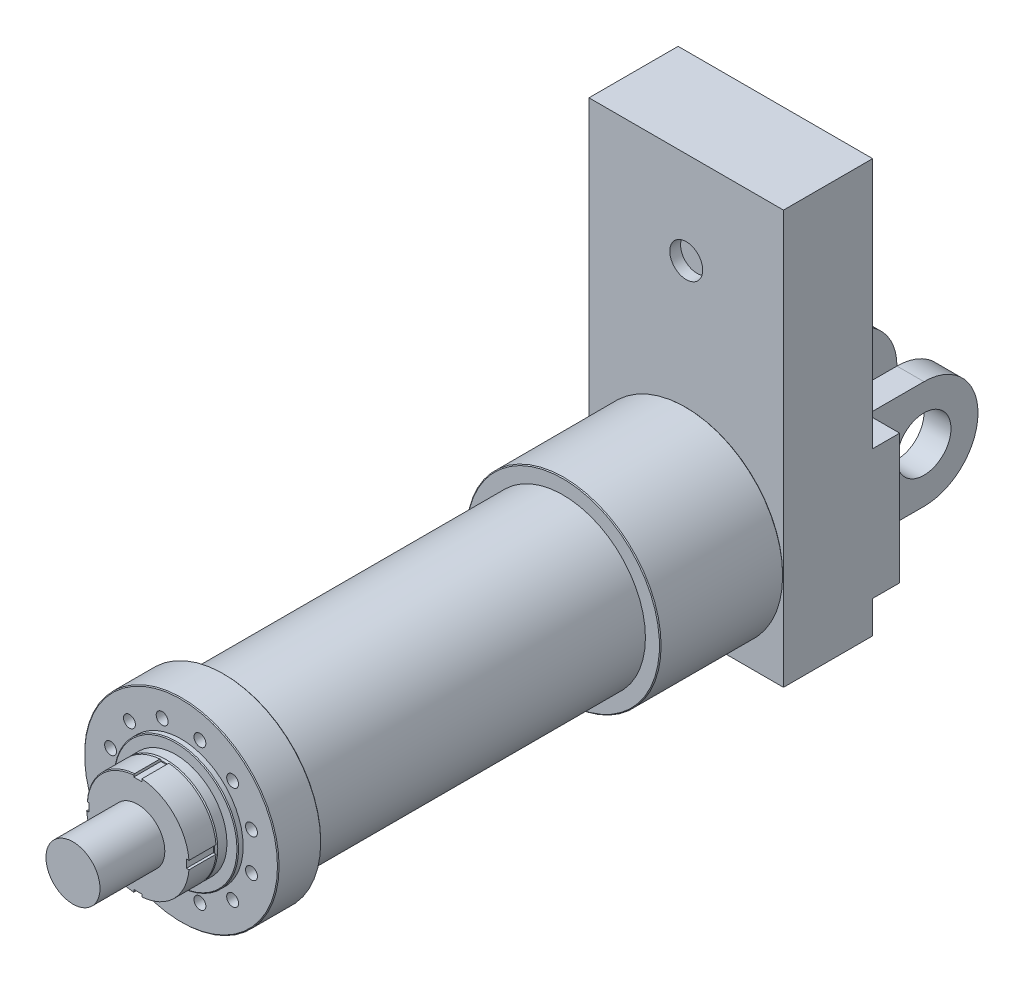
from build123d import *

# Parameters (mm, degrees)
SKETCH_1_R          = 152.5
EXTRUDE_1_DEPTH     = 627
SKETCH_2_R          = 180
SKETCH_2_R_2        = 11
EXTRUDE_2_DEPTH     = 80
SKETCH_3_R          = 115
EXTRUDE_3_DEPTH     = 10
SKETCH_4_R          = 95
EXTRUDE_4_DEPTH     = 20
CHAMFER_1_SIZE      = 3
EXTRUDE_5_DEPTH     = 50
CHAMFER_2_SIZE      = 1.5
EXTRUDE_START       = 228
SKETCH_11_R         = 180
EXTRUDE_10_DEPTH    = 228
CHAMFER_5_SIZE      = 1.5
EXTRUDE_11_DEPTH    = 165
SKETCH_16_R         = 16
CUT_EXTRUDE_4_DEPTH = 2
SKETCH_18_R         = 30.440746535
CUT_EXTRUDE_6_DEPTH = 20
SKETCH_19_R         = 50
EXTRUDE_12_DEPTH    = 120
SKETCH_20_W         = 360
SKETCH_20_H         = 240
EXTRUDE_13_DEPTH    = 50
SKETCH_21_W         = 50
SKETCH_21_H         = 200
EXTRUDE_14_DEPTH    = 225
SKETCH_22_R         = 50
CUT_EXTRUDE_7_DEPTH = 225
CHAMFER_6_SIZE      = 15


with BuildPart() as part:
    # Sketch 1 → Extrude 1 (new body)
    with BuildSketch(Plane.XY):
        Circle(SKETCH_1_R)
    extrude(amount=EXTRUDE_1_DEPTH)

    # Sketch 2 → Extrude 2 (add)
    with BuildSketch(Plane.XY.offset(627)):
        Circle(SKETCH_2_R)
        with Locations((130.399986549, 34.940571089)):
            Circle(SKETCH_2_R_2, mode=Mode.SUBTRACT)
        with Locations((130.399986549, -34.940571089)):
            Circle(SKETCH_2_R_2, mode=Mode.SUBTRACT)
        with Locations((95.45941546, -95.45941546)):
            Circle(SKETCH_2_R_2, mode=Mode.SUBTRACT)
        with Locations((34.940571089, -130.399986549)):
            Circle(SKETCH_2_R_2, mode=Mode.SUBTRACT)
        with Locations((-34.940571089, -130.399986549)):
            Circle(SKETCH_2_R_2, mode=Mode.SUBTRACT)
        with Locations((-95.45941546, -95.45941546)):
            Circle(SKETCH_2_R_2, mode=Mode.SUBTRACT)
        with Locations((-130.399986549, -34.940571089)):
            Circle(SKETCH_2_R_2, mode=Mode.SUBTRACT)
        with Locations((-130.399986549, 34.940571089)):
            Circle(SKETCH_2_R_2, mode=Mode.SUBTRACT)
        with Locations((-95.45941546, 95.45941546)):
            Circle(SKETCH_2_R_2, mode=Mode.SUBTRACT)
        with Locations((-34.940571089, 130.399986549)):
            Circle(SKETCH_2_R_2, mode=Mode.SUBTRACT)
        with Locations((34.940571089, 130.399986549)):
            Circle(SKETCH_2_R_2, mode=Mode.SUBTRACT)
        with Locations((95.45941546, 95.45941546)):
            Circle(SKETCH_2_R_2, mode=Mode.SUBTRACT)
    extrude(amount=EXTRUDE_2_DEPTH)

    # Sketch 3 → Extrude 3 (add)
    with BuildSketch(Plane.XY.offset(707)):
        Circle(SKETCH_3_R)
    extrude(amount=EXTRUDE_3_DEPTH)

    # Sketch 4 → Extrude 4 (add)
    with BuildSketch(Plane.XY.offset(717)):
        Circle(SKETCH_4_R)
    extrude(amount=EXTRUDE_4_DEPTH)

    # Chamfer 1
    chamfer_1_edges = [part.edges().sort_by_distance(p)[0] for p in [
        (-95, 0, 737),
    ]]
    chamfer(chamfer_1_edges, length=CHAMFER_1_SIZE)

    # Sketch 5 → Extrude 5 (add)
    with BuildSketch(Plane.XY.offset(737)):
        with BuildLine():
            Line((-7.5, 94.703484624), (-7.5, 90))
            Line((-7.5, 90), (7.5, 90))
            Line((7.5, 90), (7.5, 94.703484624))
            ThreePointArc((7.5, 94.703484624), (67.175144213, 67.175144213), (94.703484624, 7.5))
            Line((94.703484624, 7.5), (90, 7.5))
            Line((90, 7.5), (90, -7.5))
            Line((90, -7.5), (94.703484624, -7.5))
            ThreePointArc((94.703484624, -7.5), (67.175144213, -67.175144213), (7.5, -94.703484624))
            Line((7.5, -94.703484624), (7.5, -90))
            Line((7.5, -90), (-7.5, -90))
            Line((-7.5, -90), (-7.5, -94.703484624))
            ThreePointArc((-7.5, -94.703484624), (-67.175144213, -67.175144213), (-94.703484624, -7.5))
            Line((-94.703484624, -7.5), (-90, -7.5))
            Line((-90, -7.5), (-90, 7.5))
            Line((-90, 7.5), (-94.703484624, 7.5))
            ThreePointArc((-94.703484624, 7.5), (-67.175144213, 67.175144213), (-7.5, 94.703484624))
        make_face()
    extrude(amount=EXTRUDE_5_DEPTH)

    # Chamfer 2
    chamfer_2_edges = [part.edges().sort_by_distance(p)[0] for p in [
        (-180, 0, 707),
        (-180, 0, 627),
        (-115, 0, 717),
        (-67.175144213, 67.175144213, 737),
        (-67.175144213, 67.175144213, 787),
    ]]
    chamfer(chamfer_2_edges, length=CHAMFER_2_SIZE)

    # Sketch 11 → Extrude 10 (add)
    with BuildSketch(Plane(origin=(0, 0, 0), x_dir=(-1, 0, 0), z_dir=(0, 0, -1)).offset(EXTRUDE_START)):
        with Locations(Location((0, 0, 0), (0, 0, 180))):
            Circle(SKETCH_11_R)
    extrude(amount=-EXTRUDE_10_DEPTH)

    # Chamfer 5
    chamfer_5_edges = [part.edges().sort_by_distance(p)[0] for p in [
        (-180, 0, 0),
        (-180, 0, -228),
    ]]
    chamfer(chamfer_5_edges, length=CHAMFER_5_SIZE)

    # Sketch 16 → Cut-Extrude 4 (cut)
    with BuildSketch(Plane(origin=(-152.5, 0, 0), x_dir=(0, 0, -1), z_dir=(1, 0, 0))):
        with Locations(Location((-27, 0, 0), (0, 0, 180))):
            Circle(SKETCH_16_R)
        with Locations(Location((-551.5, 0, 0), (0, 0, 180))):
            Circle(SKETCH_16_R)
    extrude(amount=CUT_EXTRUDE_4_DEPTH, mode=Mode.SUBTRACT)

    # Sketch 19 → Extrude 12 (add)
    with BuildSketch(Plane.XY.offset(787)):
        Circle(SKETCH_19_R)
    extrude(amount=EXTRUDE_12_DEPTH)


with BuildPart() as body_2:
    # Sketch 12 → Extrude 11 (new body)
    with BuildSketch(Plane(origin=(0, 0, -228), x_dir=(-1, 0, 0), z_dir=(0, 0, -1))):
        Polygon((180, 585), (71.93747285, 585), (-71.93747285, 585), (-180, 585), (-180, 420), (-180, -87.177978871), (-180, -180), (-87.177978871, -180), (87.177978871, -180), (180, -180), (180, -87.177978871), (180, 420), align=None)
    extrude(amount=EXTRUDE_11_DEPTH)

    # Sketch 18 → Cut-Extrude 6 (cut)
    with BuildSketch(Plane.XY.offset(-228)):
        with Locations((0, 414)):
            Circle(SKETCH_18_R)
    extrude(amount=-CUT_EXTRUDE_6_DEPTH, mode=Mode.SUBTRACT)

    # Sketch 20 → Extrude 13 (add)
    with BuildSketch(Plane(origin=(0, 0, -393), x_dir=(-1, 0, 0), z_dir=(0, 0, -1))):
        Rectangle(SKETCH_20_W, SKETCH_20_H)
    extrude(amount=EXTRUDE_13_DEPTH)

    # Sketch 21 → Extrude 14 (add)
    with BuildSketch(Plane(origin=(0, 0, -443), x_dir=(-1, 0, 0), z_dir=(0, 0, -1))):
        with Locations((-75, 0)):
            Rectangle(SKETCH_21_W, SKETCH_21_H)
        with Locations((75, 0)):
            Rectangle(SKETCH_21_W, SKETCH_21_H)
    extrude(amount=EXTRUDE_14_DEPTH)

    # Sketch 22 → Cut-Extrude 7 (cut)
    with BuildSketch(Plane.ZY.offset(100)):
        with Locations(Location((-568, 0, 0), (0, 0, 270))):
            Circle(SKETCH_22_R)
        with BuildLine():
            Line((-568, 100), (-798.843617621, 151.750215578))
            Line((-798.843617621, 151.750215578), (-792.50265191, -179.036829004))
            Line((-792.50265191, -179.036829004), (-568, -100))
            ThreePointArc((-568, -100), (-668, 0), (-568, 100))
        make_face()
    extrude(amount=-CUT_EXTRUDE_7_DEPTH, mode=Mode.SUBTRACT)

    # Chamfer 6
    chamfer_6_edges = [body_2.edges().sort_by_distance(p)[0] for p in [
        (50, 0, -443),
        (75, 100, -443),
        (100, 0, -443),
        (75, -100, -443),
        (-100, 0, -443),
        (-75, 100, -443),
        (-50, 0, -443),
        (-75, -100, -443),
    ]]
    chamfer(chamfer_6_edges, length=CHAMFER_6_SIZE)


solid = Compound([part.part, body_2.part])
